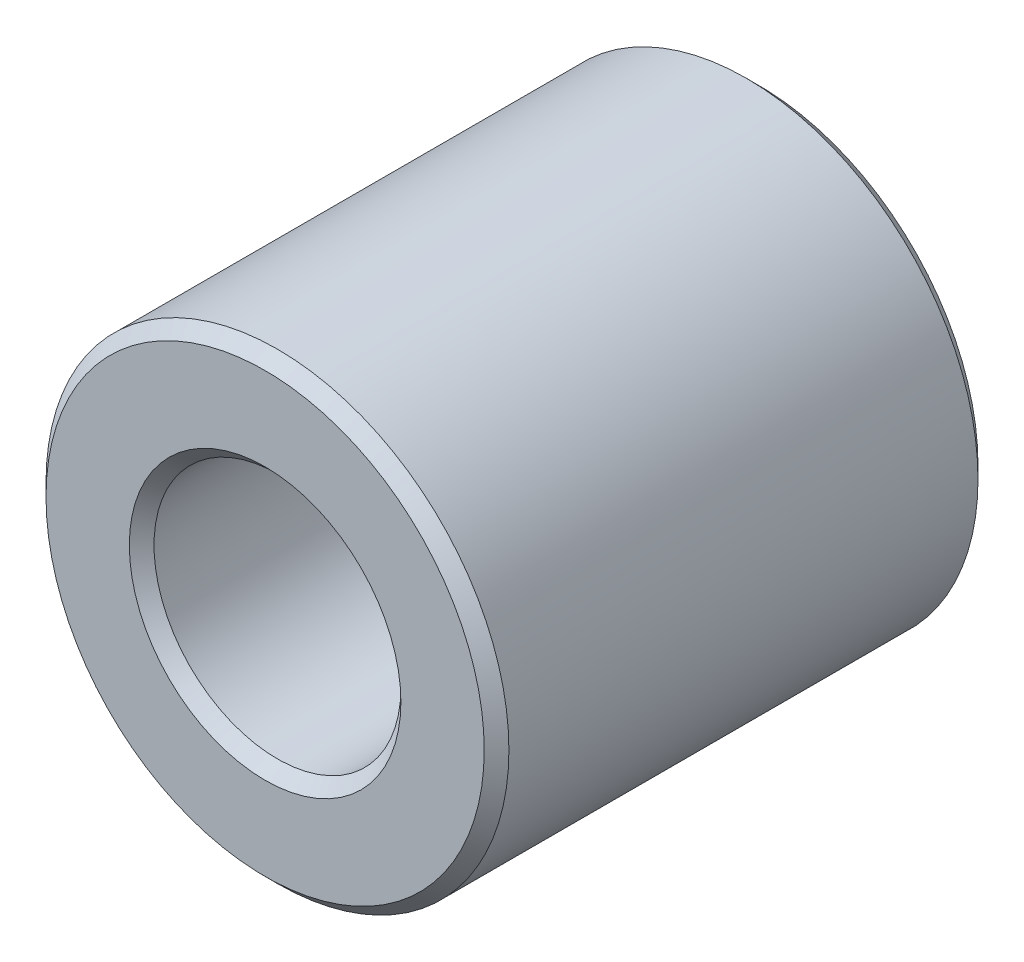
ISO-10303-21;
HEADER;
FILE_DESCRIPTION(('STEP AP214'),'2;1');
FILE_NAME('part.step','',(''),(''),'','','');
FILE_SCHEMA(('AUTOMOTIVE_DESIGN { 1 0 10303 214 1 1 1 1 }'));
ENDSEC;
DATA;
#1=APPLICATION_CONTEXT('core data for automotive mechanical design processes');
#2=APPLICATION_PROTOCOL_DEFINITION('international standard','automotive_design',2000,#1);
#3=PRODUCT_CONTEXT('',#1,'mechanical');
#4=PRODUCT('Part','Part','',(#3));
#5=PRODUCT_RELATED_PRODUCT_CATEGORY('part','',(#4));
#6=PRODUCT_DEFINITION_FORMATION('','',#4);
#7=PRODUCT_DEFINITION_CONTEXT('part definition',#1,'design');
#8=PRODUCT_DEFINITION('design','',#6,#7);
#9=PRODUCT_DEFINITION_SHAPE('','',#8);
#10=(LENGTH_UNIT() NAMED_UNIT(*) SI_UNIT(.MILLI.,.METRE.));
#11=(NAMED_UNIT(*) PLANE_ANGLE_UNIT() SI_UNIT($,.RADIAN.));
#12=(NAMED_UNIT(*) SI_UNIT($,.STERADIAN.) SOLID_ANGLE_UNIT());
#13=UNCERTAINTY_MEASURE_WITH_UNIT(LENGTH_MEASURE(1.E-05),#10,'distance_accuracy_value','');
#14=(GEOMETRIC_REPRESENTATION_CONTEXT(3) GLOBAL_UNCERTAINTY_ASSIGNED_CONTEXT((#13)) GLOBAL_UNIT_ASSIGNED_CONTEXT((#10,
#11,#12)) REPRESENTATION_CONTEXT('',''));
#15=CARTESIAN_POINT('',(0.,0.,0.));
#16=DIRECTION('',(0.,0.,1.));
#17=DIRECTION('',(1.,0.,0.));
#18=AXIS2_PLACEMENT_3D('',#15,#16,#17);
#19=CARTESIAN_POINT('',(0.,0.,32.));
#20=DIRECTION('',(0.,0.,1.));
#21=DIRECTION('',(1.,0.,0.));
#22=AXIS2_PLACEMENT_3D('',#19,#20,#21);
#23=PLANE('',#22);
#24=CARTESIAN_POINT('',(0.,0.,32.));
#25=DIRECTION('',(0.,0.,1.));
#26=DIRECTION('',(1.,0.,0.));
#27=AXIS2_PLACEMENT_3D('',#24,#25,#26);
#28=CIRCLE('',#27,17.6);
#29=CARTESIAN_POINT('',(17.6,0.,32.));
#30=VERTEX_POINT('',#29);
#31=EDGE_CURVE('E10',#30,#30,#28,.F.);
#32=ORIENTED_EDGE('',*,*,#31,.T.);
#33=EDGE_LOOP('',(#32));
#34=FACE_BOUND('',#33,.T.);
#35=CARTESIAN_POINT('',(0.,0.,32.));
#36=DIRECTION('',(0.,0.,1.));
#37=DIRECTION('',(1.,0.,0.));
#38=AXIS2_PLACEMENT_3D('',#35,#36,#37);
#39=CIRCLE('',#38,28.4);
#40=CARTESIAN_POINT('',(28.4,0.,32.));
#41=VERTEX_POINT('',#40);
#42=EDGE_CURVE('E40',#41,#41,#39,.T.);
#43=ORIENTED_EDGE('',*,*,#42,.T.);
#44=EDGE_LOOP('',(#43));
#45=FACE_BOUND('',#44,.T.);
#46=ADVANCED_FACE('F33',(#34,#45),#23,.T.);
#47=CARTESIAN_POINT('',(0.,0.,-32.));
#48=DIRECTION('',(0.,0.,1.));
#49=DIRECTION('',(1.,0.,0.));
#50=AXIS2_PLACEMENT_3D('',#47,#48,#49);
#51=PLANE('',#50);
#52=CARTESIAN_POINT('',(0.,0.,-32.));
#53=DIRECTION('',(0.,0.,1.));
#54=DIRECTION('',(1.,0.,0.));
#55=AXIS2_PLACEMENT_3D('',#52,#53,#54);
#56=CIRCLE('',#55,17.6);
#57=CARTESIAN_POINT('',(17.6,0.,-32.));
#58=VERTEX_POINT('',#57);
#59=EDGE_CURVE('E59',#58,#58,#56,.T.);
#60=ORIENTED_EDGE('',*,*,#59,.T.);
#61=EDGE_LOOP('',(#60));
#62=FACE_BOUND('',#61,.T.);
#63=CARTESIAN_POINT('',(0.,0.,-32.));
#64=DIRECTION('',(0.,0.,1.));
#65=DIRECTION('',(1.,0.,0.));
#66=AXIS2_PLACEMENT_3D('',#63,#64,#65);
#67=CIRCLE('',#66,28.4);
#68=CARTESIAN_POINT('',(28.4,0.,-32.));
#69=VERTEX_POINT('',#68);
#70=EDGE_CURVE('E62',#69,#69,#67,.F.);
#71=ORIENTED_EDGE('',*,*,#70,.T.);
#72=EDGE_LOOP('',(#71));
#73=FACE_BOUND('',#72,.T.);
#74=ADVANCED_FACE('F66',(#62,#73),#51,.F.);
#75=CARTESIAN_POINT('',(0.,0.,32.));
#76=DIRECTION('',(0.,0.,-1.));
#77=DIRECTION('',(-1.,0.,0.));
#78=AXIS2_PLACEMENT_3D('',#75,#76,#77);
#79=CYLINDRICAL_SURFACE('',#78,30.);
#80=CARTESIAN_POINT('',(0.,0.,-30.4));
#81=DIRECTION('',(0.,0.,1.));
#82=DIRECTION('',(1.,0.,0.));
#83=AXIS2_PLACEMENT_3D('',#80,#81,#82);
#84=CIRCLE('',#83,30.);
#85=CARTESIAN_POINT('',(30.,0.,-30.4));
#86=VERTEX_POINT('',#85);
#87=EDGE_CURVE('E44',#86,#86,#84,.T.);
#88=ORIENTED_EDGE('',*,*,#87,.T.);
#89=EDGE_LOOP('',(#88));
#90=FACE_BOUND('',#89,.T.);
#91=CARTESIAN_POINT('',(0.,0.,30.4));
#92=DIRECTION('',(0.,0.,1.));
#93=DIRECTION('',(1.,0.,0.));
#94=AXIS2_PLACEMENT_3D('',#91,#92,#93);
#95=CIRCLE('',#94,30.);
#96=CARTESIAN_POINT('',(30.,0.,30.4));
#97=VERTEX_POINT('',#96);
#98=EDGE_CURVE('E48',#97,#97,#95,.F.);
#99=ORIENTED_EDGE('',*,*,#98,.T.);
#100=EDGE_LOOP('',(#99));
#101=FACE_BOUND('',#100,.T.);
#102=ADVANCED_FACE('F76',(#90,#101),#79,.T.);
#103=CARTESIAN_POINT('',(0.,0.,32.));
#104=DIRECTION('',(0.,0.,-1.));
#105=DIRECTION('',(-1.,0.,0.));
#106=AXIS2_PLACEMENT_3D('',#103,#104,#105);
#107=CYLINDRICAL_SURFACE('',#106,16.);
#108=CARTESIAN_POINT('',(0.,0.,-30.4));
#109=DIRECTION('',(0.,0.,1.));
#110=DIRECTION('',(1.,0.,0.));
#111=AXIS2_PLACEMENT_3D('',#108,#109,#110);
#112=CIRCLE('',#111,16.);
#113=CARTESIAN_POINT('',(16.,0.,-30.4));
#114=VERTEX_POINT('',#113);
#115=EDGE_CURVE('E53',#114,#114,#112,.F.);
#116=ORIENTED_EDGE('',*,*,#115,.T.);
#117=EDGE_LOOP('',(#116));
#118=FACE_BOUND('',#117,.T.);
#119=CARTESIAN_POINT('',(0.,0.,30.4));
#120=DIRECTION('',(0.,0.,1.));
#121=DIRECTION('',(1.,0.,0.));
#122=AXIS2_PLACEMENT_3D('',#119,#120,#121);
#123=CIRCLE('',#122,16.);
#124=CARTESIAN_POINT('',(16.,0.,30.4));
#125=VERTEX_POINT('',#124);
#126=EDGE_CURVE('E56',#125,#125,#123,.T.);
#127=ORIENTED_EDGE('',*,*,#126,.T.);
#128=EDGE_LOOP('',(#127));
#129=FACE_BOUND('',#128,.T.);
#130=ADVANCED_FACE('F79',(#118,#129),#107,.F.);
#131=CARTESIAN_POINT('',(0.,0.,-32.));
#132=DIRECTION('',(0.,0.,-1.));
#133=DIRECTION('',(-1.,0.,0.));
#134=AXIS2_PLACEMENT_3D('',#131,#132,#133);
#135=CONICAL_SURFACE('',#134,17.6,0.785398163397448);
#136=ORIENTED_EDGE('',*,*,#115,.F.);
#137=EDGE_LOOP('',(#136));
#138=FACE_BOUND('',#137,.T.);
#139=ORIENTED_EDGE('',*,*,#59,.F.);
#140=EDGE_LOOP('',(#139));
#141=FACE_BOUND('',#140,.T.);
#142=ADVANCED_FACE('F72',(#138,#141),#135,.F.);
#143=CARTESIAN_POINT('',(0.,0.,-30.4));
#144=DIRECTION('',(0.,0.,1.));
#145=DIRECTION('',(1.,0.,0.));
#146=AXIS2_PLACEMENT_3D('',#143,#144,#145);
#147=CONICAL_SURFACE('',#146,30.,0.78539816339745);
#148=ORIENTED_EDGE('',*,*,#70,.F.);
#149=EDGE_LOOP('',(#148));
#150=FACE_BOUND('',#149,.T.);
#151=ORIENTED_EDGE('',*,*,#87,.F.);
#152=EDGE_LOOP('',(#151));
#153=FACE_BOUND('',#152,.T.);
#154=ADVANCED_FACE('F68',(#150,#153),#147,.T.);
#155=CARTESIAN_POINT('',(0.,0.,30.4));
#156=DIRECTION('',(0.,0.,1.));
#157=DIRECTION('',(1.,0.,0.));
#158=AXIS2_PLACEMENT_3D('',#155,#156,#157);
#159=CONICAL_SURFACE('',#158,16.,0.785398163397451);
#160=ORIENTED_EDGE('',*,*,#31,.F.);
#161=EDGE_LOOP('',(#160));
#162=FACE_BOUND('',#161,.T.);
#163=ORIENTED_EDGE('',*,*,#126,.F.);
#164=EDGE_LOOP('',(#163));
#165=FACE_BOUND('',#164,.T.);
#166=ADVANCED_FACE('F71',(#162,#165),#159,.F.);
#167=CARTESIAN_POINT('',(0.,0.,32.));
#168=DIRECTION('',(0.,0.,-1.));
#169=DIRECTION('',(-1.,0.,0.));
#170=AXIS2_PLACEMENT_3D('',#167,#168,#169);
#171=CONICAL_SURFACE('',#170,28.4,0.78539816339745);
#172=ORIENTED_EDGE('',*,*,#98,.F.);
#173=EDGE_LOOP('',(#172));
#174=FACE_BOUND('',#173,.T.);
#175=ORIENTED_EDGE('',*,*,#42,.F.);
#176=EDGE_LOOP('',(#175));
#177=FACE_BOUND('',#176,.T.);
#178=ADVANCED_FACE('F35',(#174,#177),#171,.T.);
#179=CLOSED_SHELL('',(#46,#74,#102,#130,#142,#154,#166,#178));
#180=MANIFOLD_SOLID_BREP('B2',#179);
#181=ADVANCED_BREP_SHAPE_REPRESENTATION('',(#18,#180),#14);
#182=SHAPE_DEFINITION_REPRESENTATION(#9,#181);
ENDSEC;
END-ISO-10303-21;
